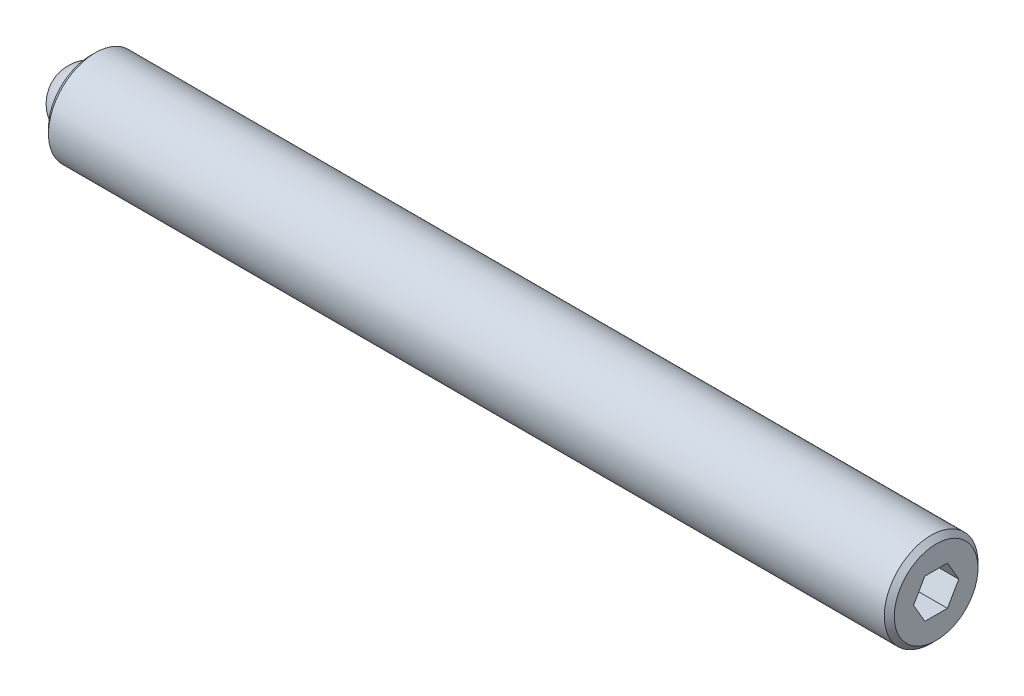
ISO-10303-21;
HEADER;
FILE_DESCRIPTION(('STEP AP214'),'2;1');
FILE_NAME('part.step','',(''),(''),'','','');
FILE_SCHEMA(('AUTOMOTIVE_DESIGN { 1 0 10303 214 1 1 1 1 }'));
ENDSEC;
DATA;
#1=APPLICATION_CONTEXT('core data for automotive mechanical design processes');
#2=APPLICATION_PROTOCOL_DEFINITION('international standard','automotive_design',2000,#1);
#3=PRODUCT_CONTEXT('',#1,'mechanical');
#4=PRODUCT('Part','Part','',(#3));
#5=PRODUCT_RELATED_PRODUCT_CATEGORY('part','',(#4));
#6=PRODUCT_DEFINITION_FORMATION('','',#4);
#7=PRODUCT_DEFINITION_CONTEXT('part definition',#1,'design');
#8=PRODUCT_DEFINITION('design','',#6,#7);
#9=PRODUCT_DEFINITION_SHAPE('','',#8);
#10=(LENGTH_UNIT() NAMED_UNIT(*) SI_UNIT(.MILLI.,.METRE.));
#11=(NAMED_UNIT(*) PLANE_ANGLE_UNIT() SI_UNIT($,.RADIAN.));
#12=(NAMED_UNIT(*) SI_UNIT($,.STERADIAN.) SOLID_ANGLE_UNIT());
#13=UNCERTAINTY_MEASURE_WITH_UNIT(LENGTH_MEASURE(1.E-05),#10,'distance_accuracy_value','');
#14=(GEOMETRIC_REPRESENTATION_CONTEXT(3) GLOBAL_UNCERTAINTY_ASSIGNED_CONTEXT((#13)) GLOBAL_UNIT_ASSIGNED_CONTEXT((#10,
#11,#12)) REPRESENTATION_CONTEXT('',''));
#15=CARTESIAN_POINT('',(0.,0.,0.));
#16=DIRECTION('',(0.,0.,1.));
#17=DIRECTION('',(1.,0.,0.));
#18=AXIS2_PLACEMENT_3D('',#15,#16,#17);
#19=CARTESIAN_POINT('',(0.,0.,0.));
#20=DIRECTION('',(0.,-1.,0.));
#21=DIRECTION('',(0.,0.,1.));
#22=AXIS2_PLACEMENT_3D('',#19,#20,#21);
#23=SPHERICAL_SURFACE('',#22,1.5875);
#24=CARTESIAN_POINT('',(0.,-1.5875,0.));
#25=VERTEX_POINT('',#24);
#26=VERTEX_LOOP('',#25);
#27=FACE_BOUND('',#26,.T.);
#28=ADVANCED_FACE('F41',(#27),#23,.T.);
#29=CLOSED_SHELL('',(#28));
#30=MANIFOLD_SOLID_BREP('B2',#29);
#31=CARTESIAN_POINT('',(42.8625,0.,0.));
#32=DIRECTION('',(-1.,0.,0.));
#33=DIRECTION('',(0.,0.,1.));
#34=AXIS2_PLACEMENT_3D('',#31,#32,#33);
#35=CYLINDRICAL_SURFACE('',#34,2.3749);
#36=CARTESIAN_POINT('',(42.6085,0.,0.));
#37=DIRECTION('',(1.,0.,0.));
#38=DIRECTION('',(0.,0.,-1.));
#39=AXIS2_PLACEMENT_3D('',#36,#37,#38);
#40=CIRCLE('',#39,2.3749);
#41=CARTESIAN_POINT('',(42.6085,0.,-2.3749));
#42=VERTEX_POINT('',#41);
#43=EDGE_CURVE('E39',#42,#42,#40,.F.);
#44=ORIENTED_EDGE('',*,*,#43,.T.);
#45=EDGE_LOOP('',(#44));
#46=FACE_BOUND('',#45,.T.);
#47=CARTESIAN_POINT('',(0.254000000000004,0.,0.));
#48=DIRECTION('',(1.,0.,0.));
#49=DIRECTION('',(0.,0.,-1.));
#50=AXIS2_PLACEMENT_3D('',#47,#48,#49);
#51=CIRCLE('',#50,2.3749);
#52=CARTESIAN_POINT('',(0.254000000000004,0.,-2.3749));
#53=VERTEX_POINT('',#52);
#54=EDGE_CURVE('E157',#53,#53,#51,.T.);
#55=ORIENTED_EDGE('',*,*,#54,.T.);
#56=EDGE_LOOP('',(#55));
#57=FACE_BOUND('',#56,.T.);
#58=ADVANCED_FACE('F54',(#46,#57),#35,.T.);
#59=CARTESIAN_POINT('',(42.8625,0.,0.));
#60=DIRECTION('',(1.,0.,0.));
#61=DIRECTION('',(0.,0.,-1.));
#62=AXIS2_PLACEMENT_3D('',#59,#60,#61);
#63=PLANE('',#62);
#64=DIRECTION('',(0.,0.866025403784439,-0.5));
#65=VECTOR('',#64,1.);
#66=CARTESIAN_POINT('',(42.8625,-0.992187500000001,-0.572839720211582));
#67=LINE('',#66,#65);
#68=CARTESIAN_POINT('',(42.8625,-0.992187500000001,-0.572839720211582));
#69=VERTEX_POINT('',#68);
#70=CARTESIAN_POINT('',(42.8625,0.,-1.14567944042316));
#71=VERTEX_POINT('',#70);
#72=EDGE_CURVE('E69',#69,#71,#67,.T.);
#73=ORIENTED_EDGE('',*,*,#72,.F.);
#74=DIRECTION('',(0.,0.,-1.));
#75=VECTOR('',#74,1.);
#76=CARTESIAN_POINT('',(42.8625,-0.992187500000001,0.572839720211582));
#77=LINE('',#76,#75);
#78=CARTESIAN_POINT('',(42.8625,-0.992187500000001,0.572839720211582));
#79=VERTEX_POINT('',#78);
#80=EDGE_CURVE('E153',#79,#69,#77,.T.);
#81=ORIENTED_EDGE('',*,*,#80,.F.);
#82=DIRECTION('',(0.,-0.866025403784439,-0.5));
#83=VECTOR('',#82,1.);
#84=CARTESIAN_POINT('',(42.8625,0.,1.14567944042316));
#85=LINE('',#84,#83);
#86=CARTESIAN_POINT('',(42.8625,0.,1.14567944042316));
#87=VERTEX_POINT('',#86);
#88=EDGE_CURVE('E151',#87,#79,#85,.T.);
#89=ORIENTED_EDGE('',*,*,#88,.F.);
#90=DIRECTION('',(0.,-0.866025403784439,0.5));
#91=VECTOR('',#90,1.);
#92=CARTESIAN_POINT('',(42.8625,0.992187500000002,0.572839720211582));
#93=LINE('',#92,#91);
#94=CARTESIAN_POINT('',(42.8625,0.992187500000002,0.572839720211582));
#95=VERTEX_POINT('',#94);
#96=EDGE_CURVE('E117',#95,#87,#93,.T.);
#97=ORIENTED_EDGE('',*,*,#96,.F.);
#98=DIRECTION('',(0.,0.,1.));
#99=VECTOR('',#98,1.);
#100=CARTESIAN_POINT('',(42.8625,0.992187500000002,-0.572839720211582));
#101=LINE('',#100,#99);
#102=CARTESIAN_POINT('',(42.8625,0.992187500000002,-0.572839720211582));
#103=VERTEX_POINT('',#102);
#104=EDGE_CURVE('E147',#103,#95,#101,.T.);
#105=ORIENTED_EDGE('',*,*,#104,.F.);
#106=DIRECTION('',(0.,0.866025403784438,0.5));
#107=VECTOR('',#106,1.);
#108=CARTESIAN_POINT('',(42.8625,0.,-1.14567944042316));
#109=LINE('',#108,#107);
#110=EDGE_CURVE('E143',#71,#103,#109,.T.);
#111=ORIENTED_EDGE('',*,*,#110,.F.);
#112=EDGE_LOOP('',(#73,#81,#89,#97,#105,#111));
#113=FACE_BOUND('',#112,.T.);
#114=CARTESIAN_POINT('',(42.8625,0.,0.));
#115=DIRECTION('',(1.,0.,0.));
#116=DIRECTION('',(0.,0.,-1.));
#117=AXIS2_PLACEMENT_3D('',#114,#115,#116);
#118=CIRCLE('',#117,2.1209);
#119=CARTESIAN_POINT('',(42.8625,0.,-2.1209));
#120=VERTEX_POINT('',#119);
#121=EDGE_CURVE('E62',#120,#120,#118,.T.);
#122=ORIENTED_EDGE('',*,*,#121,.T.);
#123=EDGE_LOOP('',(#122));
#124=FACE_BOUND('',#123,.T.);
#125=ADVANCED_FACE('F170',(#113,#124),#63,.T.);
#126=CARTESIAN_POINT('',(0.,0.,0.));
#127=DIRECTION('',(1.,0.,0.));
#128=DIRECTION('',(0.,0.,-1.));
#129=AXIS2_PLACEMENT_3D('',#126,#127,#128);
#130=PLANE('',#129);
#131=CARTESIAN_POINT('',(0.,0.,0.));
#132=DIRECTION('',(-1.,0.,0.));
#133=DIRECTION('',(0.,0.,1.));
#134=AXIS2_PLACEMENT_3D('',#131,#132,#133);
#135=CIRCLE('',#134,1.5875);
#136=CARTESIAN_POINT('',(0.,0.,1.5875));
#137=VERTEX_POINT('',#136);
#138=EDGE_CURVE('E225',#137,#137,#135,.T.);
#139=ORIENTED_EDGE('',*,*,#138,.F.);
#140=EDGE_LOOP('',(#139));
#141=FACE_BOUND('',#140,.T.);
#142=CARTESIAN_POINT('',(0.,0.,0.));
#143=DIRECTION('',(1.,0.,0.));
#144=DIRECTION('',(0.,0.,-1.));
#145=AXIS2_PLACEMENT_3D('',#142,#143,#144);
#146=CIRCLE('',#145,2.12089999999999);
#147=CARTESIAN_POINT('',(0.,0.,-2.12089999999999));
#148=VERTEX_POINT('',#147);
#149=EDGE_CURVE('E165',#148,#148,#146,.F.);
#150=ORIENTED_EDGE('',*,*,#149,.T.);
#151=EDGE_LOOP('',(#150));
#152=FACE_BOUND('',#151,.T.);
#153=ADVANCED_FACE('F182',(#141,#152),#130,.F.);
#154=CARTESIAN_POINT('',(0.254000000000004,0.,0.));
#155=DIRECTION('',(1.,0.,0.));
#156=DIRECTION('',(0.,0.,-1.));
#157=AXIS2_PLACEMENT_3D('',#154,#155,#156);
#158=CONICAL_SURFACE('',#157,2.3749,0.785398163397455);
#159=ORIENTED_EDGE('',*,*,#149,.F.);
#160=EDGE_LOOP('',(#159));
#161=FACE_BOUND('',#160,.T.);
#162=ORIENTED_EDGE('',*,*,#54,.F.);
#163=EDGE_LOOP('',(#162));
#164=FACE_BOUND('',#163,.T.);
#165=ADVANCED_FACE('F174',(#161,#164),#158,.T.);
#166=CARTESIAN_POINT('',(42.8625,0.,0.));
#167=DIRECTION('',(-1.,0.,0.));
#168=DIRECTION('',(0.,0.,1.));
#169=AXIS2_PLACEMENT_3D('',#166,#167,#168);
#170=CONICAL_SURFACE('',#169,2.1209,0.785398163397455);
#171=ORIENTED_EDGE('',*,*,#43,.F.);
#172=EDGE_LOOP('',(#171));
#173=FACE_BOUND('',#172,.T.);
#174=ORIENTED_EDGE('',*,*,#121,.F.);
#175=EDGE_LOOP('',(#174));
#176=FACE_BOUND('',#175,.T.);
#177=ADVANCED_FACE('F56',(#173,#176),#170,.T.);
#178=CARTESIAN_POINT('',(40.5765,-0.992187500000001,-0.572839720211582));
#179=DIRECTION('',(0.,-0.5,-0.866025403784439));
#180=DIRECTION('',(0.,0.866025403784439,-0.5));
#181=AXIS2_PLACEMENT_3D('',#178,#179,#180);
#182=PLANE('',#181);
#183=ORIENTED_EDGE('',*,*,#72,.T.);
#184=DIRECTION('',(1.,0.,0.));
#185=VECTOR('',#184,1.);
#186=CARTESIAN_POINT('',(40.5765,0.,-1.14567944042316));
#187=LINE('',#186,#185);
#188=CARTESIAN_POINT('',(40.5765,0.,-1.14567944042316));
#189=VERTEX_POINT('',#188);
#190=EDGE_CURVE('E99',#189,#71,#187,.T.);
#191=ORIENTED_EDGE('',*,*,#190,.F.);
#192=DIRECTION('',(0.,0.866025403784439,-0.5));
#193=VECTOR('',#192,1.);
#194=CARTESIAN_POINT('',(40.5765,-0.992187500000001,-0.572839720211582));
#195=LINE('',#194,#193);
#196=CARTESIAN_POINT('',(40.5765,-0.992187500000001,-0.572839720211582));
#197=VERTEX_POINT('',#196);
#198=EDGE_CURVE('E155',#197,#189,#195,.T.);
#199=ORIENTED_EDGE('',*,*,#198,.F.);
#200=DIRECTION('',(1.,0.,0.));
#201=VECTOR('',#200,1.);
#202=CARTESIAN_POINT('',(40.5765,-0.992187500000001,-0.572839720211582));
#203=LINE('',#202,#201);
#204=EDGE_CURVE('E77',#197,#69,#203,.T.);
#205=ORIENTED_EDGE('',*,*,#204,.T.);
#206=EDGE_LOOP('',(#183,#191,#199,#205));
#207=FACE_BOUND('',#206,.T.);
#208=ADVANCED_FACE('F173',(#207),#182,.F.);
#209=CARTESIAN_POINT('',(40.5765,-0.992187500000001,0.572839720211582));
#210=DIRECTION('',(0.,-1.,0.));
#211=DIRECTION('',(0.,0.,-1.));
#212=AXIS2_PLACEMENT_3D('',#209,#210,#211);
#213=PLANE('',#212);
#214=ORIENTED_EDGE('',*,*,#80,.T.);
#215=ORIENTED_EDGE('',*,*,#204,.F.);
#216=DIRECTION('',(0.,0.,-1.));
#217=VECTOR('',#216,1.);
#218=CARTESIAN_POINT('',(40.5765,-0.992187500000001,0.572839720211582));
#219=LINE('',#218,#217);
#220=CARTESIAN_POINT('',(40.5765,-0.992187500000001,0.572839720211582));
#221=VERTEX_POINT('',#220);
#222=EDGE_CURVE('E129',#221,#197,#219,.T.);
#223=ORIENTED_EDGE('',*,*,#222,.F.);
#224=DIRECTION('',(1.,0.,0.));
#225=VECTOR('',#224,1.);
#226=CARTESIAN_POINT('',(40.5765,-0.992187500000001,0.572839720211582));
#227=LINE('',#226,#225);
#228=EDGE_CURVE('E121',#221,#79,#227,.T.);
#229=ORIENTED_EDGE('',*,*,#228,.T.);
#230=EDGE_LOOP('',(#214,#215,#223,#229));
#231=FACE_BOUND('',#230,.T.);
#232=ADVANCED_FACE('F180',(#231),#213,.F.);
#233=CARTESIAN_POINT('',(40.5765,0.,1.14567944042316));
#234=DIRECTION('',(0.,-0.5,0.866025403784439));
#235=DIRECTION('',(0.,-0.866025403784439,-0.5));
#236=AXIS2_PLACEMENT_3D('',#233,#234,#235);
#237=PLANE('',#236);
#238=ORIENTED_EDGE('',*,*,#88,.T.);
#239=ORIENTED_EDGE('',*,*,#228,.F.);
#240=DIRECTION('',(0.,-0.866025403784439,-0.5));
#241=VECTOR('',#240,1.);
#242=CARTESIAN_POINT('',(40.5765,0.,1.14567944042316));
#243=LINE('',#242,#241);
#244=CARTESIAN_POINT('',(40.5765,0.,1.14567944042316));
#245=VERTEX_POINT('',#244);
#246=EDGE_CURVE('E125',#245,#221,#243,.T.);
#247=ORIENTED_EDGE('',*,*,#246,.F.);
#248=DIRECTION('',(1.,0.,0.));
#249=VECTOR('',#248,1.);
#250=CARTESIAN_POINT('',(40.5765,0.,1.14567944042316));
#251=LINE('',#250,#249);
#252=EDGE_CURVE('E110',#245,#87,#251,.T.);
#253=ORIENTED_EDGE('',*,*,#252,.T.);
#254=EDGE_LOOP('',(#238,#239,#247,#253));
#255=FACE_BOUND('',#254,.T.);
#256=ADVANCED_FACE('F126',(#255),#237,.F.);
#257=CARTESIAN_POINT('',(40.5765,0.992187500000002,0.572839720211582));
#258=DIRECTION('',(0.,0.5,0.866025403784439));
#259=DIRECTION('',(0.,-0.866025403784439,0.5));
#260=AXIS2_PLACEMENT_3D('',#257,#258,#259);
#261=PLANE('',#260);
#262=ORIENTED_EDGE('',*,*,#96,.T.);
#263=ORIENTED_EDGE('',*,*,#252,.F.);
#264=DIRECTION('',(0.,-0.866025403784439,0.5));
#265=VECTOR('',#264,1.);
#266=CARTESIAN_POINT('',(40.5765,0.992187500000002,0.572839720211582));
#267=LINE('',#266,#265);
#268=CARTESIAN_POINT('',(40.5765,0.992187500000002,0.572839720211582));
#269=VERTEX_POINT('',#268);
#270=EDGE_CURVE('E114',#269,#245,#267,.T.);
#271=ORIENTED_EDGE('',*,*,#270,.F.);
#272=DIRECTION('',(1.,0.,0.));
#273=VECTOR('',#272,1.);
#274=CARTESIAN_POINT('',(40.5765,0.992187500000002,0.572839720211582));
#275=LINE('',#274,#273);
#276=EDGE_CURVE('E122',#269,#95,#275,.T.);
#277=ORIENTED_EDGE('',*,*,#276,.T.);
#278=EDGE_LOOP('',(#262,#263,#271,#277));
#279=FACE_BOUND('',#278,.T.);
#280=ADVANCED_FACE('F112',(#279),#261,.F.);
#281=CARTESIAN_POINT('',(40.5765,0.992187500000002,-0.572839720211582));
#282=DIRECTION('',(0.,1.,0.));
#283=DIRECTION('',(0.,0.,1.));
#284=AXIS2_PLACEMENT_3D('',#281,#282,#283);
#285=PLANE('',#284);
#286=ORIENTED_EDGE('',*,*,#104,.T.);
#287=ORIENTED_EDGE('',*,*,#276,.F.);
#288=DIRECTION('',(0.,0.,1.));
#289=VECTOR('',#288,1.);
#290=CARTESIAN_POINT('',(40.5765,0.992187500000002,-0.572839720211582));
#291=LINE('',#290,#289);
#292=CARTESIAN_POINT('',(40.5765,0.992187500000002,-0.572839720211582));
#293=VERTEX_POINT('',#292);
#294=EDGE_CURVE('E135',#293,#269,#291,.T.);
#295=ORIENTED_EDGE('',*,*,#294,.F.);
#296=DIRECTION('',(1.,0.,0.));
#297=VECTOR('',#296,1.);
#298=CARTESIAN_POINT('',(40.5765,0.992187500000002,-0.572839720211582));
#299=LINE('',#298,#297);
#300=EDGE_CURVE('E160',#293,#103,#299,.T.);
#301=ORIENTED_EDGE('',*,*,#300,.T.);
#302=EDGE_LOOP('',(#286,#287,#295,#301));
#303=FACE_BOUND('',#302,.T.);
#304=ADVANCED_FACE('F201',(#303),#285,.F.);
#305=CARTESIAN_POINT('',(40.5765,0.,-1.14567944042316));
#306=DIRECTION('',(0.,0.5,-0.866025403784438));
#307=DIRECTION('',(0.,0.866025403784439,0.5));
#308=AXIS2_PLACEMENT_3D('',#305,#306,#307);
#309=PLANE('',#308);
#310=ORIENTED_EDGE('',*,*,#110,.T.);
#311=ORIENTED_EDGE('',*,*,#300,.F.);
#312=DIRECTION('',(0.,0.866025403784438,0.5));
#313=VECTOR('',#312,1.);
#314=CARTESIAN_POINT('',(40.5765,0.,-1.14567944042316));
#315=LINE('',#314,#313);
#316=EDGE_CURVE('E137',#189,#293,#315,.T.);
#317=ORIENTED_EDGE('',*,*,#316,.F.);
#318=ORIENTED_EDGE('',*,*,#190,.T.);
#319=EDGE_LOOP('',(#310,#311,#317,#318));
#320=FACE_BOUND('',#319,.T.);
#321=ADVANCED_FACE('F198',(#320),#309,.F.);
#322=CARTESIAN_POINT('',(40.5765,0.,0.));
#323=DIRECTION('',(1.,0.,0.));
#324=DIRECTION('',(0.,0.,-1.));
#325=AXIS2_PLACEMENT_3D('',#322,#323,#324);
#326=PLANE('',#325);
#327=ORIENTED_EDGE('',*,*,#198,.T.);
#328=ORIENTED_EDGE('',*,*,#316,.T.);
#329=ORIENTED_EDGE('',*,*,#294,.T.);
#330=ORIENTED_EDGE('',*,*,#270,.T.);
#331=ORIENTED_EDGE('',*,*,#246,.T.);
#332=ORIENTED_EDGE('',*,*,#222,.T.);
#333=EDGE_LOOP('',(#327,#328,#329,#330,#331,#332));
#334=FACE_BOUND('',#333,.T.);
#335=ADVANCED_FACE('F132',(#334),#326,.T.);
#336=CARTESIAN_POINT('',(1.5875,0.,0.));
#337=DIRECTION('',(-1.,0.,0.));
#338=DIRECTION('',(0.,0.,1.));
#339=AXIS2_PLACEMENT_3D('',#336,#337,#338);
#340=CYLINDRICAL_SURFACE('',#339,1.5875);
#341=CARTESIAN_POINT('',(1.5875,0.,0.));
#342=DIRECTION('',(-1.,0.,0.));
#343=DIRECTION('',(0.,0.,1.));
#344=AXIS2_PLACEMENT_3D('',#341,#342,#343);
#345=CIRCLE('',#344,1.5875);
#346=CARTESIAN_POINT('',(1.5875,0.,1.5875));
#347=VERTEX_POINT('',#346);
#348=EDGE_CURVE('E144',#347,#347,#345,.T.);
#349=ORIENTED_EDGE('',*,*,#348,.F.);
#350=EDGE_LOOP('',(#349));
#351=FACE_BOUND('',#350,.T.);
#352=ORIENTED_EDGE('',*,*,#138,.T.);
#353=EDGE_LOOP('',(#352));
#354=FACE_BOUND('',#353,.T.);
#355=ADVANCED_FACE('F214',(#351,#354),#340,.F.);
#356=CARTESIAN_POINT('',(1.5875,0.,0.));
#357=DIRECTION('',(-1.,0.,0.));
#358=DIRECTION('',(0.,0.,1.));
#359=AXIS2_PLACEMENT_3D('',#356,#357,#358);
#360=PLANE('',#359);
#361=ORIENTED_EDGE('',*,*,#348,.T.);
#362=EDGE_LOOP('',(#361));
#363=FACE_BOUND('',#362,.T.);
#364=ADVANCED_FACE('F217',(#363),#360,.T.);
#365=CLOSED_SHELL('',(#58,#125,#153,#165,#177,#208,#232,#256,#280,#304,#321,#335,#355,#364));
#366=MANIFOLD_SOLID_BREP('B6',#365);
#367=ADVANCED_BREP_SHAPE_REPRESENTATION('',(#18,#30,#366),#14);
#368=SHAPE_DEFINITION_REPRESENTATION(#9,#367);
ENDSEC;
END-ISO-10303-21;
